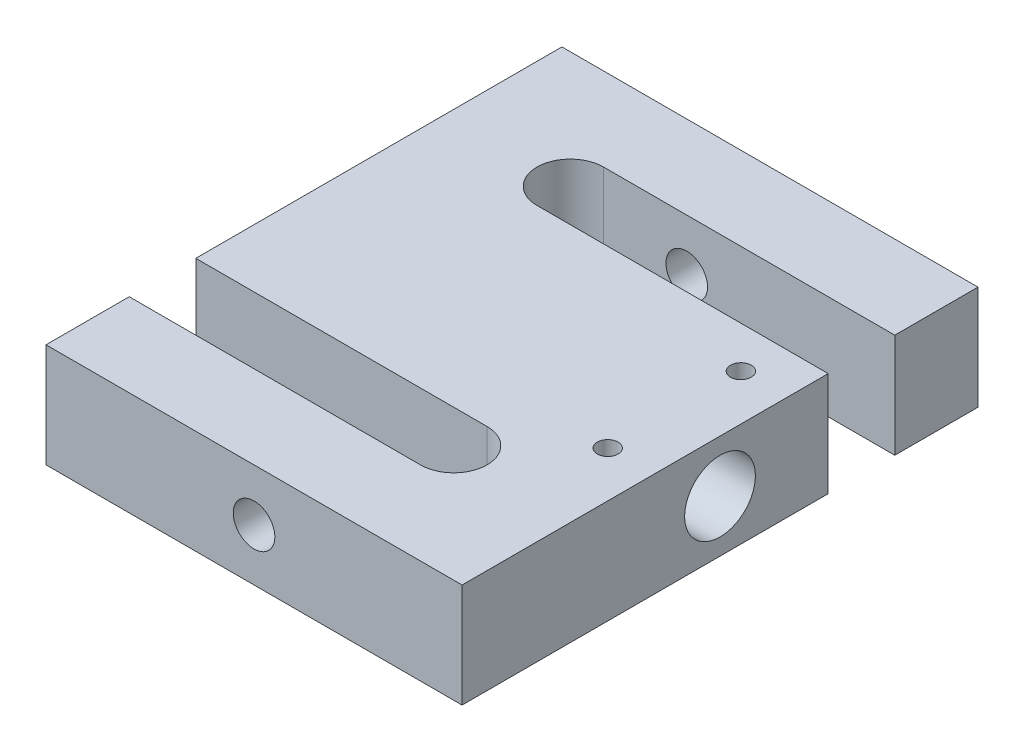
from build123d import *

# Parameters (mm, degrees)
BOSS_EXTRU_1_DEPTH                            = 12.5
TROU_POUR_TARAUDAGE_POUR_TROU_TARAUD_M3_D     = 2.5
TROU_POUR_TARAUDAGE_POUR_TROU_TARAUD_M6_D     = 5
TROU_POUR_TARAUDAGE_POUR_TROU_TARAUD_M6_DEPTH = 10
TROU_POUR_TARAUDAGE_POUR_TROU_TARAUD_2_D      = 5
TROU_POUR_TARAUDAGE_POUR_TROU_TARAUD_2_DEPTH  = 10
TROU_POUR_TARAUDAGE_POUR_TROU_TARAUD_M1_D     = 8.5
TROU_POUR_TARAUDAGE_POUR_TROU_TARAUD_M1_DEPTH = 10
TROU_POUR_TARAUDAGE_POUR_TROU_TARAUD_M1_TIP   = 2.553657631


with BuildPart() as part:
    # Esquisse1 → Boss.-Extru.1 (new body)
    with BuildSketch(Plane(origin=(0, 0, 0), x_dir=(1, 0, 0), z_dir=(0, 1, 0))):
        with BuildLine():
            Line((0, 0), (50, 0))
            Line((50, 0), (50, 44))
            Line((50, 44), (15, 44))
            ThreePointArc((15, 44), (11, 48), (15, 52))
            Line((15, 52), (50, 52))
            Line((50, 52), (50, 62))
            Line((50, 62), (0, 62))
            Line((0, 62), (0, 18))
            Line((0, 18), (35, 18))
            ThreePointArc((35, 18), (39, 14), (35, 10))
            Line((35, 10), (0, 10))
            Line((0, 10), (0, 0))
        make_face()
    extrude(amount=BOSS_EXTRU_1_DEPTH)

    # Trou pour taraudage pour trou taraud_ M3 (through all)
    with Locations(Plane(origin=(0, 12.5, 0), x_dir=(1, 0, 0), z_dir=(0, 1, 0))):
        with Locations((44.5, 39), (44.5, 23)):
            Hole(TROU_POUR_TARAUDAGE_POUR_TROU_TARAUD_M3_D / 2)

    # Trou pour taraudage pour trou taraud_ M6
    with Locations(Plane.XY):
        with Locations((25, 6.25)):
            Hole(TROU_POUR_TARAUDAGE_POUR_TROU_TARAUD_M6_D / 2, depth=TROU_POUR_TARAUDAGE_POUR_TROU_TARAUD_M6_DEPTH)

    # Trou pour taraudage pour trou taraud 2
    with Locations(Plane(origin=(0, 0, -62), x_dir=(-1, 0, 0), z_dir=(0, 0, -1))):
        with Locations((-25, 6.25)):
            Hole(TROU_POUR_TARAUDAGE_POUR_TROU_TARAUD_2_D / 2, depth=TROU_POUR_TARAUDAGE_POUR_TROU_TARAUD_2_DEPTH)

    # Trou pour taraudage pour trou taraud_ M1
    with Locations(Plane(origin=(50, 0, 0), x_dir=(0, 0, -1), z_dir=(1, 0, 0))):
        with Locations((31, 6.25)):
            Hole(TROU_POUR_TARAUDAGE_POUR_TROU_TARAUD_M1_D / 2, depth=TROU_POUR_TARAUDAGE_POUR_TROU_TARAUD_M1_DEPTH)
            with Locations((0, 0, -(TROU_POUR_TARAUDAGE_POUR_TROU_TARAUD_M1_DEPTH + TROU_POUR_TARAUDAGE_POUR_TROU_TARAUD_M1_TIP / 2))):  # 118° drill point
                Cone(0, TROU_POUR_TARAUDAGE_POUR_TROU_TARAUD_M1_D / 2, TROU_POUR_TARAUDAGE_POUR_TROU_TARAUD_M1_TIP, mode=Mode.SUBTRACT)


solid = part.part
